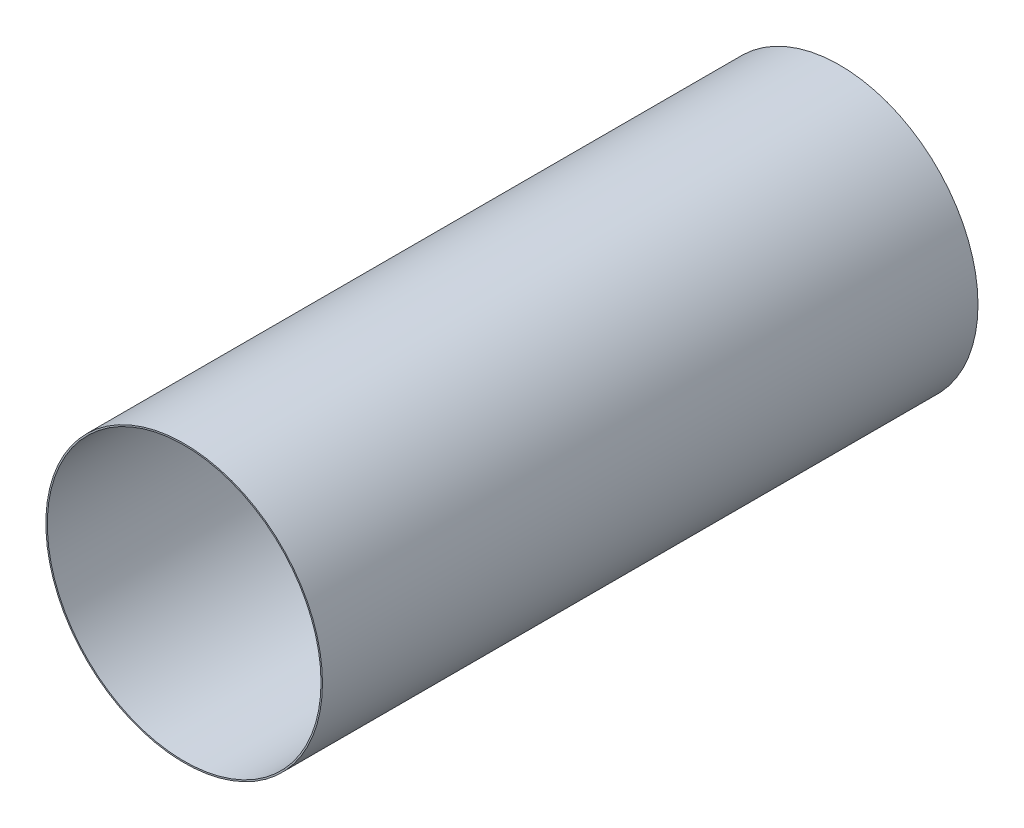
ISO-10303-21;
HEADER;
FILE_DESCRIPTION(('STEP AP214'),'2;1');
FILE_NAME('part.step','',(''),(''),'','','');
FILE_SCHEMA(('AUTOMOTIVE_DESIGN { 1 0 10303 214 1 1 1 1 }'));
ENDSEC;
DATA;
#1=APPLICATION_CONTEXT('core data for automotive mechanical design processes');
#2=APPLICATION_PROTOCOL_DEFINITION('international standard','automotive_design',2000,#1);
#3=PRODUCT_CONTEXT('',#1,'mechanical');
#4=PRODUCT('Part','Part','',(#3));
#5=PRODUCT_RELATED_PRODUCT_CATEGORY('part','',(#4));
#6=PRODUCT_DEFINITION_FORMATION('','',#4);
#7=PRODUCT_DEFINITION_CONTEXT('part definition',#1,'design');
#8=PRODUCT_DEFINITION('design','',#6,#7);
#9=PRODUCT_DEFINITION_SHAPE('','',#8);
#10=(LENGTH_UNIT() NAMED_UNIT(*) SI_UNIT(.MILLI.,.METRE.));
#11=(NAMED_UNIT(*) PLANE_ANGLE_UNIT() SI_UNIT($,.RADIAN.));
#12=(NAMED_UNIT(*) SI_UNIT($,.STERADIAN.) SOLID_ANGLE_UNIT());
#13=UNCERTAINTY_MEASURE_WITH_UNIT(LENGTH_MEASURE(1.E-05),#10,'distance_accuracy_value','');
#14=(GEOMETRIC_REPRESENTATION_CONTEXT(3) GLOBAL_UNCERTAINTY_ASSIGNED_CONTEXT((#13)) GLOBAL_UNIT_ASSIGNED_CONTEXT((#10,
#11,#12)) REPRESENTATION_CONTEXT('',''));
#15=CARTESIAN_POINT('',(0.,0.,0.));
#16=DIRECTION('',(0.,0.,1.));
#17=DIRECTION('',(1.,0.,0.));
#18=AXIS2_PLACEMENT_3D('',#15,#16,#17);
#19=CARTESIAN_POINT('',(0.,0.,-91.));
#20=DIRECTION('',(0.,0.,1.));
#21=DIRECTION('',(1.,0.,0.));
#22=AXIS2_PLACEMENT_3D('',#19,#20,#21);
#23=CYLINDRICAL_SURFACE('',#22,19.2);
#24=CARTESIAN_POINT('',(0.,0.,-91.));
#25=DIRECTION('',(0.,0.,1.));
#26=DIRECTION('',(1.,0.,0.));
#27=AXIS2_PLACEMENT_3D('',#24,#25,#26);
#28=CIRCLE('',#27,19.2);
#29=CARTESIAN_POINT('',(19.2,0.,-91.));
#30=VERTEX_POINT('',#29);
#31=EDGE_CURVE('E10',#30,#30,#28,.T.);
#32=ORIENTED_EDGE('',*,*,#31,.T.);
#33=EDGE_LOOP('',(#32));
#34=FACE_BOUND('',#33,.T.);
#35=CARTESIAN_POINT('',(0.,0.,0.));
#36=DIRECTION('',(0.,0.,1.));
#37=DIRECTION('',(1.,0.,0.));
#38=AXIS2_PLACEMENT_3D('',#35,#36,#37);
#39=CIRCLE('',#38,19.2);
#40=CARTESIAN_POINT('',(19.2,0.,0.));
#41=VERTEX_POINT('',#40);
#42=EDGE_CURVE('E40',#41,#41,#39,.T.);
#43=ORIENTED_EDGE('',*,*,#42,.F.);
#44=EDGE_LOOP('',(#43));
#45=FACE_BOUND('',#44,.T.);
#46=ADVANCED_FACE('F37',(#34,#45),#23,.T.);
#47=CARTESIAN_POINT('',(0.,0.,-91.));
#48=DIRECTION('',(0.,0.,1.));
#49=DIRECTION('',(1.,0.,0.));
#50=AXIS2_PLACEMENT_3D('',#47,#48,#49);
#51=PLANE('',#50);
#52=CARTESIAN_POINT('',(0.,0.,-91.));
#53=DIRECTION('',(0.,0.,1.));
#54=DIRECTION('',(1.,0.,0.));
#55=AXIS2_PLACEMENT_3D('',#52,#53,#54);
#56=CIRCLE('',#55,19.);
#57=CARTESIAN_POINT('',(19.,0.,-91.));
#58=VERTEX_POINT('',#57);
#59=EDGE_CURVE('E47',#58,#58,#56,.T.);
#60=ORIENTED_EDGE('',*,*,#59,.T.);
#61=EDGE_LOOP('',(#60));
#62=FACE_BOUND('',#61,.T.);
#63=ORIENTED_EDGE('',*,*,#31,.F.);
#64=EDGE_LOOP('',(#63));
#65=FACE_BOUND('',#64,.T.);
#66=ADVANCED_FACE('F55',(#62,#65),#51,.F.);
#67=CARTESIAN_POINT('',(0.,0.,0.));
#68=DIRECTION('',(0.,0.,1.));
#69=DIRECTION('',(1.,0.,0.));
#70=AXIS2_PLACEMENT_3D('',#67,#68,#69);
#71=PLANE('',#70);
#72=CARTESIAN_POINT('',(0.,0.,0.));
#73=DIRECTION('',(0.,0.,1.));
#74=DIRECTION('',(1.,0.,0.));
#75=AXIS2_PLACEMENT_3D('',#72,#73,#74);
#76=CIRCLE('',#75,19.);
#77=CARTESIAN_POINT('',(19.,0.,0.));
#78=VERTEX_POINT('',#77);
#79=EDGE_CURVE('E49',#78,#78,#76,.T.);
#80=ORIENTED_EDGE('',*,*,#79,.F.);
#81=EDGE_LOOP('',(#80));
#82=FACE_BOUND('',#81,.T.);
#83=ORIENTED_EDGE('',*,*,#42,.T.);
#84=EDGE_LOOP('',(#83));
#85=FACE_BOUND('',#84,.T.);
#86=ADVANCED_FACE('F61',(#82,#85),#71,.T.);
#87=CARTESIAN_POINT('',(0.,0.,-91.));
#88=DIRECTION('',(0.,0.,1.));
#89=DIRECTION('',(1.,0.,0.));
#90=AXIS2_PLACEMENT_3D('',#87,#88,#89);
#91=CYLINDRICAL_SURFACE('',#90,19.);
#92=ORIENTED_EDGE('',*,*,#59,.F.);
#93=EDGE_LOOP('',(#92));
#94=FACE_BOUND('',#93,.T.);
#95=ORIENTED_EDGE('',*,*,#79,.T.);
#96=EDGE_LOOP('',(#95));
#97=FACE_BOUND('',#96,.T.);
#98=ADVANCED_FACE('F58',(#94,#97),#91,.F.);
#99=CLOSED_SHELL('',(#46,#66,#86,#98));
#100=MANIFOLD_SOLID_BREP('B2',#99);
#101=ADVANCED_BREP_SHAPE_REPRESENTATION('',(#18,#100),#14);
#102=SHAPE_DEFINITION_REPRESENTATION(#9,#101);
ENDSEC;
END-ISO-10303-21;
